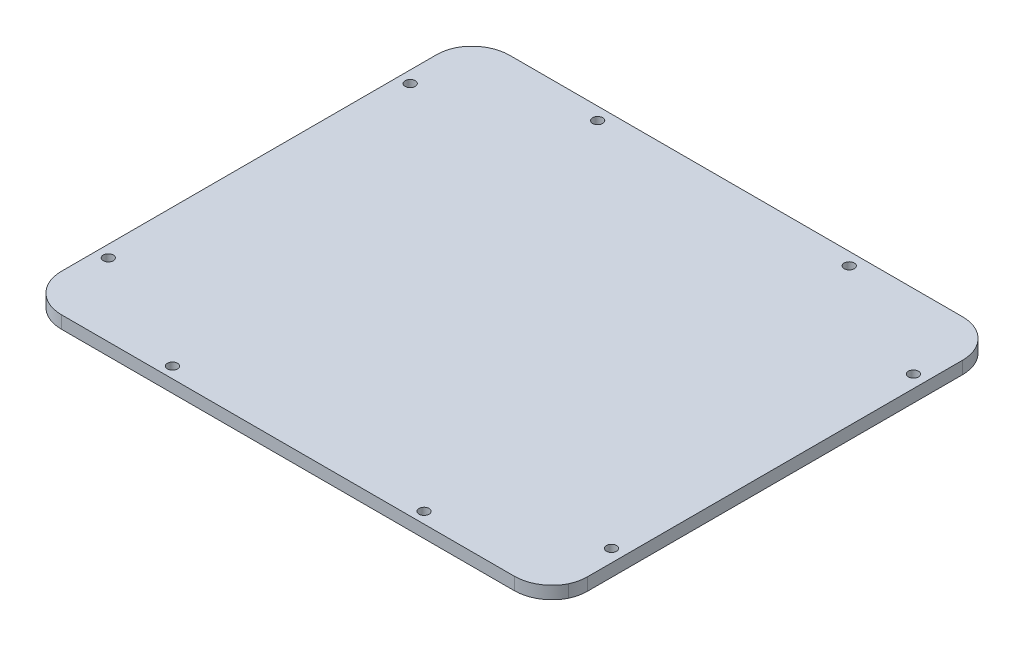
ISO-10303-21;
HEADER;
FILE_DESCRIPTION(('STEP AP214'),'2;1');
FILE_NAME('part.step','',(''),(''),'','','');
FILE_SCHEMA(('AUTOMOTIVE_DESIGN { 1 0 10303 214 1 1 1 1 }'));
ENDSEC;
DATA;
#1=APPLICATION_CONTEXT('core data for automotive mechanical design processes');
#2=APPLICATION_PROTOCOL_DEFINITION('international standard','automotive_design',2000,#1);
#3=PRODUCT_CONTEXT('',#1,'mechanical');
#4=PRODUCT('Part','Part','',(#3));
#5=PRODUCT_RELATED_PRODUCT_CATEGORY('part','',(#4));
#6=PRODUCT_DEFINITION_FORMATION('','',#4);
#7=PRODUCT_DEFINITION_CONTEXT('part definition',#1,'design');
#8=PRODUCT_DEFINITION('design','',#6,#7);
#9=PRODUCT_DEFINITION_SHAPE('','',#8);
#10=(LENGTH_UNIT() NAMED_UNIT(*) SI_UNIT(.MILLI.,.METRE.));
#11=(NAMED_UNIT(*) PLANE_ANGLE_UNIT() SI_UNIT($,.RADIAN.));
#12=(NAMED_UNIT(*) SI_UNIT($,.STERADIAN.) SOLID_ANGLE_UNIT());
#13=UNCERTAINTY_MEASURE_WITH_UNIT(LENGTH_MEASURE(1.E-05),#10,'distance_accuracy_value','');
#14=(GEOMETRIC_REPRESENTATION_CONTEXT(3) GLOBAL_UNCERTAINTY_ASSIGNED_CONTEXT((#13)) GLOBAL_UNIT_ASSIGNED_CONTEXT((#10,
#11,#12)) REPRESENTATION_CONTEXT('',''));
#15=CARTESIAN_POINT('',(0.,0.,0.));
#16=DIRECTION('',(0.,0.,1.));
#17=DIRECTION('',(1.,0.,0.));
#18=AXIS2_PLACEMENT_3D('',#15,#16,#17);
#19=CARTESIAN_POINT('',(0.,5.,-88.8910959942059));
#20=DIRECTION('',(0.,0.,1.));
#21=DIRECTION('',(1.,0.,0.));
#22=AXIS2_PLACEMENT_3D('',#19,#20,#21);
#23=PLANE('',#22);
#24=DIRECTION('',(-1.,0.,0.));
#25=VECTOR('',#24,1.);
#26=CARTESIAN_POINT('',(0.,0.,-88.8910959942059));
#27=LINE('',#26,#25);
#28=CARTESIAN_POINT('',(89.7019969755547,0.,-88.8910959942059));
#29=VERTEX_POINT('',#28);
#30=CARTESIAN_POINT('',(-90.2980030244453,0.,-88.8910959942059));
#31=VERTEX_POINT('',#30);
#32=EDGE_CURVE('E175',#29,#31,#27,.T.);
#33=ORIENTED_EDGE('',*,*,#32,.T.);
#34=DIRECTION('',(0.,-1.,0.));
#35=VECTOR('',#34,1.);
#36=CARTESIAN_POINT('',(-90.2980030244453,5.,-88.8910959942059));
#37=LINE('',#36,#35);
#38=CARTESIAN_POINT('',(-90.2980030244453,5.,-88.8910959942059));
#39=VERTEX_POINT('',#38);
#40=EDGE_CURVE('E11',#39,#31,#37,.T.);
#41=ORIENTED_EDGE('',*,*,#40,.F.);
#42=DIRECTION('',(-1.,0.,0.));
#43=VECTOR('',#42,1.);
#44=CARTESIAN_POINT('',(0.,5.,-88.8910959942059));
#45=LINE('',#44,#43);
#46=CARTESIAN_POINT('',(89.7019969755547,5.,-88.8910959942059));
#47=VERTEX_POINT('',#46);
#48=EDGE_CURVE('E226',#47,#39,#45,.T.);
#49=ORIENTED_EDGE('',*,*,#48,.F.);
#50=DIRECTION('',(0.,-1.,0.));
#51=VECTOR('',#50,1.);
#52=CARTESIAN_POINT('',(89.7019969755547,5.,-88.8910959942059));
#53=LINE('',#52,#51);
#54=EDGE_CURVE('E145',#47,#29,#53,.T.);
#55=ORIENTED_EDGE('',*,*,#54,.T.);
#56=EDGE_LOOP('',(#33,#41,#49,#55));
#57=FACE_BOUND('',#56,.T.);
#58=ADVANCED_FACE('F39',(#57),#23,.F.);
#59=CARTESIAN_POINT('',(-90.2980030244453,5.,-73.8910959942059));
#60=DIRECTION('',(0.,-1.,0.));
#61=DIRECTION('',(0.,0.,-1.));
#62=AXIS2_PLACEMENT_3D('',#59,#60,#61);
#63=CYLINDRICAL_SURFACE('',#62,15.);
#64=CARTESIAN_POINT('',(-90.2980030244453,0.,-73.8910959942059));
#65=DIRECTION('',(0.,1.,0.));
#66=DIRECTION('',(0.,0.,1.));
#67=AXIS2_PLACEMENT_3D('',#64,#65,#66);
#68=CIRCLE('',#67,15.);
#69=CARTESIAN_POINT('',(-103.618561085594,0.,-80.7876699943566));
#70=VERTEX_POINT('',#69);
#71=EDGE_CURVE('E173',#31,#70,#68,.T.);
#72=ORIENTED_EDGE('',*,*,#71,.T.);
#73=DIRECTION('',(0.,-1.,0.));
#74=VECTOR('',#73,1.);
#75=CARTESIAN_POINT('',(-103.618561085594,5.,-80.7876699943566));
#76=LINE('',#75,#74);
#77=CARTESIAN_POINT('',(-103.618561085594,5.,-80.7876699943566));
#78=VERTEX_POINT('',#77);
#79=EDGE_CURVE('E48',#78,#70,#76,.T.);
#80=ORIENTED_EDGE('',*,*,#79,.F.);
#81=CARTESIAN_POINT('',(-90.2980030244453,5.,-73.8910959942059));
#82=DIRECTION('',(0.,1.,0.));
#83=DIRECTION('',(0.,0.,1.));
#84=AXIS2_PLACEMENT_3D('',#81,#82,#83);
#85=CIRCLE('',#84,15.);
#86=EDGE_CURVE('E104',#39,#78,#85,.T.);
#87=ORIENTED_EDGE('',*,*,#86,.F.);
#88=ORIENTED_EDGE('',*,*,#40,.T.);
#89=EDGE_LOOP('',(#72,#80,#87,#88));
#90=FACE_BOUND('',#89,.T.);
#91=ADVANCED_FACE('F215',(#90),#63,.T.);
#92=CARTESIAN_POINT('',(-90.,5.,-74.5));
#93=DIRECTION('',(0.,-1.,0.));
#94=DIRECTION('',(0.,0.,-1.));
#95=AXIS2_PLACEMENT_3D('',#92,#93,#94);
#96=CYLINDRICAL_SURFACE('',#95,15.);
#97=CARTESIAN_POINT('',(-90.,0.,-74.5));
#98=DIRECTION('',(0.,1.,0.));
#99=DIRECTION('',(0.,0.,1.));
#100=AXIS2_PLACEMENT_3D('',#97,#98,#99);
#101=CIRCLE('',#100,15.);
#102=CARTESIAN_POINT('',(-105.,0.,-74.5));
#103=VERTEX_POINT('',#102);
#104=EDGE_CURVE('E179',#103,#70,#101,.F.);
#105=ORIENTED_EDGE('',*,*,#104,.F.);
#106=DIRECTION('',(0.,-1.,0.));
#107=VECTOR('',#106,1.);
#108=CARTESIAN_POINT('',(-105.,5.,-74.5));
#109=LINE('',#108,#107);
#110=CARTESIAN_POINT('',(-105.,5.,-74.5));
#111=VERTEX_POINT('',#110);
#112=EDGE_CURVE('E202',#111,#103,#109,.T.);
#113=ORIENTED_EDGE('',*,*,#112,.F.);
#114=CARTESIAN_POINT('',(-90.,5.,-74.5));
#115=DIRECTION('',(0.,1.,0.));
#116=DIRECTION('',(0.,0.,1.));
#117=AXIS2_PLACEMENT_3D('',#114,#115,#116);
#118=CIRCLE('',#117,15.);
#119=EDGE_CURVE('E211',#111,#78,#118,.F.);
#120=ORIENTED_EDGE('',*,*,#119,.T.);
#121=ORIENTED_EDGE('',*,*,#79,.T.);
#122=EDGE_LOOP('',(#105,#113,#120,#121));
#123=FACE_BOUND('',#122,.T.);
#124=ADVANCED_FACE('F207',(#123),#96,.T.);
#125=CARTESIAN_POINT('',(-105.,5.,0.));
#126=DIRECTION('',(-1.,0.,0.));
#127=DIRECTION('',(0.,0.,1.));
#128=AXIS2_PLACEMENT_3D('',#125,#126,#127);
#129=PLANE('',#128);
#130=DIRECTION('',(0.,0.,-1.));
#131=VECTOR('',#130,1.);
#132=CARTESIAN_POINT('',(-105.,0.,0.));
#133=LINE('',#132,#131);
#134=CARTESIAN_POINT('',(-105.,0.,74.5));
#135=VERTEX_POINT('',#134);
#136=EDGE_CURVE('E182',#135,#103,#133,.T.);
#137=ORIENTED_EDGE('',*,*,#136,.F.);
#138=DIRECTION('',(0.,-1.,0.));
#139=VECTOR('',#138,1.);
#140=CARTESIAN_POINT('',(-105.,5.,74.5));
#141=LINE('',#140,#139);
#142=CARTESIAN_POINT('',(-105.,5.,74.5));
#143=VERTEX_POINT('',#142);
#144=EDGE_CURVE('E201',#143,#135,#141,.T.);
#145=ORIENTED_EDGE('',*,*,#144,.F.);
#146=DIRECTION('',(0.,0.,-1.));
#147=VECTOR('',#146,1.);
#148=CARTESIAN_POINT('',(-105.,5.,0.));
#149=LINE('',#148,#147);
#150=EDGE_CURVE('E223',#143,#111,#149,.T.);
#151=ORIENTED_EDGE('',*,*,#150,.T.);
#152=ORIENTED_EDGE('',*,*,#112,.T.);
#153=EDGE_LOOP('',(#137,#145,#151,#152));
#154=FACE_BOUND('',#153,.T.);
#155=ADVANCED_FACE('F222',(#154),#129,.T.);
#156=CARTESIAN_POINT('',(-90.,5.,74.5));
#157=DIRECTION('',(0.,-1.,0.));
#158=DIRECTION('',(0.,0.,-1.));
#159=AXIS2_PLACEMENT_3D('',#156,#157,#158);
#160=CYLINDRICAL_SURFACE('',#159,15.);
#161=CARTESIAN_POINT('',(-90.,0.,74.5));
#162=DIRECTION('',(0.,1.,0.));
#163=DIRECTION('',(0.,0.,1.));
#164=AXIS2_PLACEMENT_3D('',#161,#162,#163);
#165=CIRCLE('',#164,15.);
#166=CARTESIAN_POINT('',(-90.,0.,89.5));
#167=VERTEX_POINT('',#166);
#168=EDGE_CURVE('E184',#135,#167,#165,.T.);
#169=ORIENTED_EDGE('',*,*,#168,.T.);
#170=DIRECTION('',(0.,-1.,0.));
#171=VECTOR('',#170,1.);
#172=CARTESIAN_POINT('',(-90.,5.,89.5));
#173=LINE('',#172,#171);
#174=CARTESIAN_POINT('',(-90.,5.,89.5));
#175=VERTEX_POINT('',#174);
#176=EDGE_CURVE('E199',#175,#167,#173,.T.);
#177=ORIENTED_EDGE('',*,*,#176,.F.);
#178=CARTESIAN_POINT('',(-90.,5.,74.5));
#179=DIRECTION('',(0.,1.,0.));
#180=DIRECTION('',(0.,0.,1.));
#181=AXIS2_PLACEMENT_3D('',#178,#179,#180);
#182=CIRCLE('',#181,15.);
#183=EDGE_CURVE('E230',#143,#175,#182,.T.);
#184=ORIENTED_EDGE('',*,*,#183,.F.);
#185=ORIENTED_EDGE('',*,*,#144,.T.);
#186=EDGE_LOOP('',(#169,#177,#184,#185));
#187=FACE_BOUND('',#186,.T.);
#188=ADVANCED_FACE('F411',(#187),#160,.T.);
#189=CARTESIAN_POINT('',(0.,5.,89.5));
#190=DIRECTION('',(0.,0.,-1.));
#191=DIRECTION('',(-1.,0.,0.));
#192=AXIS2_PLACEMENT_3D('',#189,#190,#191);
#193=PLANE('',#192);
#194=DIRECTION('',(1.,0.,0.));
#195=VECTOR('',#194,1.);
#196=CARTESIAN_POINT('',(0.,0.,89.5));
#197=LINE('',#196,#195);
#198=CARTESIAN_POINT('',(90.,0.,89.5));
#199=VERTEX_POINT('',#198);
#200=EDGE_CURVE('E187',#167,#199,#197,.T.);
#201=ORIENTED_EDGE('',*,*,#200,.T.);
#202=DIRECTION('',(0.,-1.,0.));
#203=VECTOR('',#202,1.);
#204=CARTESIAN_POINT('',(90.,5.,89.5));
#205=LINE('',#204,#203);
#206=CARTESIAN_POINT('',(90.,5.,89.5));
#207=VERTEX_POINT('',#206);
#208=EDGE_CURVE('E197',#207,#199,#205,.T.);
#209=ORIENTED_EDGE('',*,*,#208,.F.);
#210=DIRECTION('',(1.,0.,0.));
#211=VECTOR('',#210,1.);
#212=CARTESIAN_POINT('',(0.,5.,89.5));
#213=LINE('',#212,#211);
#214=EDGE_CURVE('E233',#175,#207,#213,.T.);
#215=ORIENTED_EDGE('',*,*,#214,.F.);
#216=ORIENTED_EDGE('',*,*,#176,.T.);
#217=EDGE_LOOP('',(#201,#209,#215,#216));
#218=FACE_BOUND('',#217,.T.);
#219=ADVANCED_FACE('F239',(#218),#193,.F.);
#220=CARTESIAN_POINT('',(90.,5.,74.5));
#221=DIRECTION('',(0.,-1.,0.));
#222=DIRECTION('',(0.,0.,-1.));
#223=AXIS2_PLACEMENT_3D('',#220,#221,#222);
#224=CYLINDRICAL_SURFACE('',#223,15.);
#225=CARTESIAN_POINT('',(90.,0.,74.5));
#226=DIRECTION('',(0.,1.,0.));
#227=DIRECTION('',(0.,0.,1.));
#228=AXIS2_PLACEMENT_3D('',#225,#226,#227);
#229=CIRCLE('',#228,15.);
#230=CARTESIAN_POINT('',(103.320558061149,0.,81.3965740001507));
#231=VERTEX_POINT('',#230);
#232=EDGE_CURVE('E189',#199,#231,#229,.T.);
#233=ORIENTED_EDGE('',*,*,#232,.T.);
#234=DIRECTION('',(0.,-1.,0.));
#235=VECTOR('',#234,1.);
#236=CARTESIAN_POINT('',(103.320558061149,5.,81.3965740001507));
#237=LINE('',#236,#235);
#238=CARTESIAN_POINT('',(103.320558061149,5.,81.3965740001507));
#239=VERTEX_POINT('',#238);
#240=EDGE_CURVE('E138',#239,#231,#237,.T.);
#241=ORIENTED_EDGE('',*,*,#240,.F.);
#242=CARTESIAN_POINT('',(90.,5.,74.5));
#243=DIRECTION('',(0.,1.,0.));
#244=DIRECTION('',(0.,0.,1.));
#245=AXIS2_PLACEMENT_3D('',#242,#243,#244);
#246=CIRCLE('',#245,15.);
#247=EDGE_CURVE('E128',#207,#239,#246,.T.);
#248=ORIENTED_EDGE('',*,*,#247,.F.);
#249=ORIENTED_EDGE('',*,*,#208,.T.);
#250=EDGE_LOOP('',(#233,#241,#248,#249));
#251=FACE_BOUND('',#250,.T.);
#252=ADVANCED_FACE('F245',(#251),#224,.T.);
#253=CARTESIAN_POINT('',(89.7019969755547,5.,75.1089040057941));
#254=DIRECTION('',(0.,-1.,0.));
#255=DIRECTION('',(0.,0.,-1.));
#256=AXIS2_PLACEMENT_3D('',#253,#254,#255);
#257=CYLINDRICAL_SURFACE('',#256,15.);
#258=CARTESIAN_POINT('',(89.7019969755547,0.,75.1089040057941));
#259=DIRECTION('',(0.,1.,0.));
#260=DIRECTION('',(0.,0.,1.));
#261=AXIS2_PLACEMENT_3D('',#258,#259,#260);
#262=CIRCLE('',#261,15.);
#263=CARTESIAN_POINT('',(104.701996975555,0.,75.1089040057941));
#264=VERTEX_POINT('',#263);
#265=EDGE_CURVE('E139',#231,#264,#262,.T.);
#266=ORIENTED_EDGE('',*,*,#265,.T.);
#267=DIRECTION('',(0.,-1.,0.));
#268=VECTOR('',#267,1.);
#269=CARTESIAN_POINT('',(104.701996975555,5.,75.1089040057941));
#270=LINE('',#269,#268);
#271=CARTESIAN_POINT('',(104.701996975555,5.,75.1089040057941));
#272=VERTEX_POINT('',#271);
#273=EDGE_CURVE('E133',#272,#264,#270,.T.);
#274=ORIENTED_EDGE('',*,*,#273,.F.);
#275=CARTESIAN_POINT('',(89.7019969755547,5.,75.1089040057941));
#276=DIRECTION('',(0.,1.,0.));
#277=DIRECTION('',(0.,0.,1.));
#278=AXIS2_PLACEMENT_3D('',#275,#276,#277);
#279=CIRCLE('',#278,15.);
#280=EDGE_CURVE('E123',#239,#272,#279,.T.);
#281=ORIENTED_EDGE('',*,*,#280,.F.);
#282=ORIENTED_EDGE('',*,*,#240,.T.);
#283=EDGE_LOOP('',(#266,#274,#281,#282));
#284=FACE_BOUND('',#283,.T.);
#285=ADVANCED_FACE('F136',(#284),#257,.T.);
#286=CARTESIAN_POINT('',(104.701996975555,5.,0.));
#287=DIRECTION('',(-1.,0.,0.));
#288=DIRECTION('',(0.,0.,1.));
#289=AXIS2_PLACEMENT_3D('',#286,#287,#288);
#290=PLANE('',#289);
#291=DIRECTION('',(0.,0.,-1.));
#292=VECTOR('',#291,1.);
#293=CARTESIAN_POINT('',(104.701996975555,0.,0.));
#294=LINE('',#293,#292);
#295=CARTESIAN_POINT('',(104.701996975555,0.,-73.8910959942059));
#296=VERTEX_POINT('',#295);
#297=EDGE_CURVE('E93',#264,#296,#294,.T.);
#298=ORIENTED_EDGE('',*,*,#297,.T.);
#299=DIRECTION('',(0.,-1.,0.));
#300=VECTOR('',#299,1.);
#301=CARTESIAN_POINT('',(104.701996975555,5.,-73.8910959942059));
#302=LINE('',#301,#300);
#303=CARTESIAN_POINT('',(104.701996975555,5.,-73.8910959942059));
#304=VERTEX_POINT('',#303);
#305=EDGE_CURVE('E140',#304,#296,#302,.T.);
#306=ORIENTED_EDGE('',*,*,#305,.F.);
#307=DIRECTION('',(0.,0.,-1.));
#308=VECTOR('',#307,1.);
#309=CARTESIAN_POINT('',(104.701996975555,5.,0.));
#310=LINE('',#309,#308);
#311=EDGE_CURVE('E126',#272,#304,#310,.T.);
#312=ORIENTED_EDGE('',*,*,#311,.F.);
#313=ORIENTED_EDGE('',*,*,#273,.T.);
#314=EDGE_LOOP('',(#298,#306,#312,#313));
#315=FACE_BOUND('',#314,.T.);
#316=ADVANCED_FACE('F142',(#315),#290,.F.);
#317=CARTESIAN_POINT('',(-50.2980030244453,5.,-83.8910959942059));
#318=DIRECTION('',(0.,-1.,0.));
#319=DIRECTION('',(0.,0.,-1.));
#320=AXIS2_PLACEMENT_3D('',#317,#318,#319);
#321=CYLINDRICAL_SURFACE('',#320,2.);
#322=CARTESIAN_POINT('',(-50.2980030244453,5.,-83.8910959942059));
#323=DIRECTION('',(0.,1.,0.));
#324=DIRECTION('',(0.,0.,1.));
#325=AXIS2_PLACEMENT_3D('',#322,#323,#324);
#326=CIRCLE('',#325,2.);
#327=CARTESIAN_POINT('',(-50.2980030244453,5.,-81.8910959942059));
#328=VERTEX_POINT('',#327);
#329=EDGE_CURVE('E468',#328,#328,#326,.T.);
#330=ORIENTED_EDGE('',*,*,#329,.T.);
#331=EDGE_LOOP('',(#330));
#332=FACE_BOUND('',#331,.T.);
#333=CARTESIAN_POINT('',(-50.2980030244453,0.,-83.8910959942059));
#334=DIRECTION('',(0.,1.,0.));
#335=DIRECTION('',(0.,0.,1.));
#336=AXIS2_PLACEMENT_3D('',#333,#334,#335);
#337=CIRCLE('',#336,2.);
#338=CARTESIAN_POINT('',(-50.2980030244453,0.,-81.8910959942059));
#339=VERTEX_POINT('',#338);
#340=EDGE_CURVE('E166',#339,#339,#337,.T.);
#341=ORIENTED_EDGE('',*,*,#340,.F.);
#342=EDGE_LOOP('',(#341));
#343=FACE_BOUND('',#342,.T.);
#344=ADVANCED_FACE('F266',(#332,#343),#321,.F.);
#345=CARTESIAN_POINT('',(49.7019969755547,5.,-83.8910959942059));
#346=DIRECTION('',(0.,-1.,0.));
#347=DIRECTION('',(0.,0.,-1.));
#348=AXIS2_PLACEMENT_3D('',#345,#346,#347);
#349=CYLINDRICAL_SURFACE('',#348,2.);
#350=CARTESIAN_POINT('',(49.7019969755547,5.,-83.8910959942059));
#351=DIRECTION('',(0.,1.,0.));
#352=DIRECTION('',(0.,0.,1.));
#353=AXIS2_PLACEMENT_3D('',#350,#351,#352);
#354=CIRCLE('',#353,2.);
#355=CARTESIAN_POINT('',(49.7019969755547,5.,-81.8910959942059));
#356=VERTEX_POINT('',#355);
#357=EDGE_CURVE('E466',#356,#356,#354,.T.);
#358=ORIENTED_EDGE('',*,*,#357,.T.);
#359=EDGE_LOOP('',(#358));
#360=FACE_BOUND('',#359,.T.);
#361=CARTESIAN_POINT('',(49.7019969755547,0.,-83.8910959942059));
#362=DIRECTION('',(0.,1.,0.));
#363=DIRECTION('',(0.,0.,1.));
#364=AXIS2_PLACEMENT_3D('',#361,#362,#363);
#365=CIRCLE('',#364,2.);
#366=CARTESIAN_POINT('',(49.7019969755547,0.,-81.8910959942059));
#367=VERTEX_POINT('',#366);
#368=EDGE_CURVE('E167',#367,#367,#365,.T.);
#369=ORIENTED_EDGE('',*,*,#368,.F.);
#370=EDGE_LOOP('',(#369));
#371=FACE_BOUND('',#370,.T.);
#372=ADVANCED_FACE('F267',(#360,#371),#349,.F.);
#373=CARTESIAN_POINT('',(99.7019969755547,5.,-59.3910959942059));
#374=DIRECTION('',(0.,-1.,0.));
#375=DIRECTION('',(0.,0.,-1.));
#376=AXIS2_PLACEMENT_3D('',#373,#374,#375);
#377=CYLINDRICAL_SURFACE('',#376,2.);
#378=CARTESIAN_POINT('',(99.7019969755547,5.,-59.3910959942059));
#379=DIRECTION('',(0.,1.,0.));
#380=DIRECTION('',(0.,0.,1.));
#381=AXIS2_PLACEMENT_3D('',#378,#379,#380);
#382=CIRCLE('',#381,2.);
#383=CARTESIAN_POINT('',(99.7019969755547,5.,-57.3910959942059));
#384=VERTEX_POINT('',#383);
#385=EDGE_CURVE('E464',#384,#384,#382,.T.);
#386=ORIENTED_EDGE('',*,*,#385,.T.);
#387=EDGE_LOOP('',(#386));
#388=FACE_BOUND('',#387,.T.);
#389=CARTESIAN_POINT('',(99.7019969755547,0.,-59.3910959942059));
#390=DIRECTION('',(0.,1.,0.));
#391=DIRECTION('',(0.,0.,1.));
#392=AXIS2_PLACEMENT_3D('',#389,#390,#391);
#393=CIRCLE('',#392,2.);
#394=CARTESIAN_POINT('',(99.7019969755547,0.,-57.3910959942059));
#395=VERTEX_POINT('',#394);
#396=EDGE_CURVE('E162',#395,#395,#393,.T.);
#397=ORIENTED_EDGE('',*,*,#396,.F.);
#398=EDGE_LOOP('',(#397));
#399=FACE_BOUND('',#398,.T.);
#400=ADVANCED_FACE('F272',(#388,#399),#377,.F.);
#401=CARTESIAN_POINT('',(99.7019969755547,5.,60.6089040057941));
#402=DIRECTION('',(0.,-1.,0.));
#403=DIRECTION('',(0.,0.,-1.));
#404=AXIS2_PLACEMENT_3D('',#401,#402,#403);
#405=CYLINDRICAL_SURFACE('',#404,2.);
#406=CARTESIAN_POINT('',(99.7019969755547,5.,60.6089040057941));
#407=DIRECTION('',(0.,1.,0.));
#408=DIRECTION('',(0.,0.,1.));
#409=AXIS2_PLACEMENT_3D('',#406,#407,#408);
#410=CIRCLE('',#409,2.);
#411=CARTESIAN_POINT('',(99.7019969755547,5.,62.6089040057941));
#412=VERTEX_POINT('',#411);
#413=EDGE_CURVE('E458',#412,#412,#410,.T.);
#414=ORIENTED_EDGE('',*,*,#413,.T.);
#415=EDGE_LOOP('',(#414));
#416=FACE_BOUND('',#415,.T.);
#417=CARTESIAN_POINT('',(99.7019969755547,0.,60.6089040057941));
#418=DIRECTION('',(0.,1.,0.));
#419=DIRECTION('',(0.,0.,1.));
#420=AXIS2_PLACEMENT_3D('',#417,#418,#419);
#421=CIRCLE('',#420,2.);
#422=CARTESIAN_POINT('',(99.7019969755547,0.,62.6089040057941));
#423=VERTEX_POINT('',#422);
#424=EDGE_CURVE('E159',#423,#423,#421,.T.);
#425=ORIENTED_EDGE('',*,*,#424,.F.);
#426=EDGE_LOOP('',(#425));
#427=FACE_BOUND('',#426,.T.);
#428=ADVANCED_FACE('F280',(#416,#427),#405,.F.);
#429=CARTESIAN_POINT('',(49.7019969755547,5.,85.1089040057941));
#430=DIRECTION('',(0.,-1.,0.));
#431=DIRECTION('',(0.,0.,-1.));
#432=AXIS2_PLACEMENT_3D('',#429,#430,#431);
#433=CYLINDRICAL_SURFACE('',#432,2.);
#434=CARTESIAN_POINT('',(49.7019969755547,5.,85.1089040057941));
#435=DIRECTION('',(0.,1.,0.));
#436=DIRECTION('',(0.,0.,1.));
#437=AXIS2_PLACEMENT_3D('',#434,#435,#436);
#438=CIRCLE('',#437,2.);
#439=CARTESIAN_POINT('',(49.7019969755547,5.,87.1089040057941));
#440=VERTEX_POINT('',#439);
#441=EDGE_CURVE('E454',#440,#440,#438,.T.);
#442=ORIENTED_EDGE('',*,*,#441,.T.);
#443=EDGE_LOOP('',(#442));
#444=FACE_BOUND('',#443,.T.);
#445=CARTESIAN_POINT('',(49.7019969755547,0.,85.1089040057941));
#446=DIRECTION('',(0.,1.,0.));
#447=DIRECTION('',(0.,0.,1.));
#448=AXIS2_PLACEMENT_3D('',#445,#446,#447);
#449=CIRCLE('',#448,2.);
#450=CARTESIAN_POINT('',(49.7019969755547,0.,87.1089040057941));
#451=VERTEX_POINT('',#450);
#452=EDGE_CURVE('E160',#451,#451,#449,.T.);
#453=ORIENTED_EDGE('',*,*,#452,.F.);
#454=EDGE_LOOP('',(#453));
#455=FACE_BOUND('',#454,.T.);
#456=ADVANCED_FACE('F282',(#444,#455),#433,.F.);
#457=CARTESIAN_POINT('',(-50.2980030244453,5.,85.1089040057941));
#458=DIRECTION('',(0.,-1.,0.));
#459=DIRECTION('',(0.,0.,-1.));
#460=AXIS2_PLACEMENT_3D('',#457,#458,#459);
#461=CYLINDRICAL_SURFACE('',#460,2.);
#462=CARTESIAN_POINT('',(-50.2980030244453,5.,85.1089040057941));
#463=DIRECTION('',(0.,1.,0.));
#464=DIRECTION('',(0.,0.,1.));
#465=AXIS2_PLACEMENT_3D('',#462,#463,#464);
#466=CIRCLE('',#465,2.);
#467=CARTESIAN_POINT('',(-50.2980030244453,5.,87.1089040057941));
#468=VERTEX_POINT('',#467);
#469=EDGE_CURVE('E448',#468,#468,#466,.T.);
#470=ORIENTED_EDGE('',*,*,#469,.T.);
#471=EDGE_LOOP('',(#470));
#472=FACE_BOUND('',#471,.T.);
#473=CARTESIAN_POINT('',(-50.2980030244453,0.,85.1089040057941));
#474=DIRECTION('',(0.,1.,0.));
#475=DIRECTION('',(0.,0.,1.));
#476=AXIS2_PLACEMENT_3D('',#473,#474,#475);
#477=CIRCLE('',#476,2.);
#478=CARTESIAN_POINT('',(-50.2980030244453,0.,87.1089040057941));
#479=VERTEX_POINT('',#478);
#480=EDGE_CURVE('E152',#479,#479,#477,.T.);
#481=ORIENTED_EDGE('',*,*,#480,.F.);
#482=EDGE_LOOP('',(#481));
#483=FACE_BOUND('',#482,.T.);
#484=ADVANCED_FACE('F283',(#472,#483),#461,.F.);
#485=CARTESIAN_POINT('',(-100.298003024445,5.,60.6089040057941));
#486=DIRECTION('',(0.,-1.,0.));
#487=DIRECTION('',(0.,0.,-1.));
#488=AXIS2_PLACEMENT_3D('',#485,#486,#487);
#489=CYLINDRICAL_SURFACE('',#488,2.);
#490=CARTESIAN_POINT('',(-100.298003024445,5.,60.6089040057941));
#491=DIRECTION('',(0.,1.,0.));
#492=DIRECTION('',(0.,0.,1.));
#493=AXIS2_PLACEMENT_3D('',#490,#491,#492);
#494=CIRCLE('',#493,2.);
#495=CARTESIAN_POINT('',(-100.298003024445,5.,62.6089040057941));
#496=VERTEX_POINT('',#495);
#497=EDGE_CURVE('E297',#496,#496,#494,.T.);
#498=ORIENTED_EDGE('',*,*,#497,.T.);
#499=EDGE_LOOP('',(#498));
#500=FACE_BOUND('',#499,.T.);
#501=CARTESIAN_POINT('',(-100.298003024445,0.,60.6089040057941));
#502=DIRECTION('',(0.,1.,0.));
#503=DIRECTION('',(0.,0.,1.));
#504=AXIS2_PLACEMENT_3D('',#501,#502,#503);
#505=CIRCLE('',#504,2.);
#506=CARTESIAN_POINT('',(-100.298003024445,0.,62.6089040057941));
#507=VERTEX_POINT('',#506);
#508=EDGE_CURVE('E151',#507,#507,#505,.T.);
#509=ORIENTED_EDGE('',*,*,#508,.F.);
#510=EDGE_LOOP('',(#509));
#511=FACE_BOUND('',#510,.T.);
#512=ADVANCED_FACE('F255',(#500,#511),#489,.F.);
#513=CARTESIAN_POINT('',(-100.298003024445,5.,-59.3910959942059));
#514=DIRECTION('',(0.,-1.,0.));
#515=DIRECTION('',(0.,0.,-1.));
#516=AXIS2_PLACEMENT_3D('',#513,#514,#515);
#517=CYLINDRICAL_SURFACE('',#516,2.);
#518=CARTESIAN_POINT('',(-100.298003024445,5.,-59.3910959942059));
#519=DIRECTION('',(0.,1.,0.));
#520=DIRECTION('',(0.,0.,1.));
#521=AXIS2_PLACEMENT_3D('',#518,#519,#520);
#522=CIRCLE('',#521,2.);
#523=CARTESIAN_POINT('',(-100.298003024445,5.,-57.3910959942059));
#524=VERTEX_POINT('',#523);
#525=EDGE_CURVE('E194',#524,#524,#522,.T.);
#526=ORIENTED_EDGE('',*,*,#525,.T.);
#527=EDGE_LOOP('',(#526));
#528=FACE_BOUND('',#527,.T.);
#529=CARTESIAN_POINT('',(-100.298003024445,0.,-59.3910959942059));
#530=DIRECTION('',(0.,1.,0.));
#531=DIRECTION('',(0.,0.,1.));
#532=AXIS2_PLACEMENT_3D('',#529,#530,#531);
#533=CIRCLE('',#532,2.);
#534=CARTESIAN_POINT('',(-100.298003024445,0.,-57.3910959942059));
#535=VERTEX_POINT('',#534);
#536=EDGE_CURVE('E146',#535,#535,#533,.T.);
#537=ORIENTED_EDGE('',*,*,#536,.F.);
#538=EDGE_LOOP('',(#537));
#539=FACE_BOUND('',#538,.T.);
#540=ADVANCED_FACE('F41',(#528,#539),#517,.F.);
#541=CARTESIAN_POINT('',(89.7019969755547,5.,-73.8910959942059));
#542=DIRECTION('',(0.,-1.,0.));
#543=DIRECTION('',(0.,0.,-1.));
#544=AXIS2_PLACEMENT_3D('',#541,#542,#543);
#545=CYLINDRICAL_SURFACE('',#544,15.);
#546=CARTESIAN_POINT('',(89.7019969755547,0.,-73.8910959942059));
#547=DIRECTION('',(0.,1.,0.));
#548=DIRECTION('',(0.,0.,1.));
#549=AXIS2_PLACEMENT_3D('',#546,#547,#548);
#550=CIRCLE('',#549,15.);
#551=EDGE_CURVE('E100',#296,#29,#550,.T.);
#552=ORIENTED_EDGE('',*,*,#551,.T.);
#553=ORIENTED_EDGE('',*,*,#54,.F.);
#554=CARTESIAN_POINT('',(89.7019969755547,5.,-73.8910959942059));
#555=DIRECTION('',(0.,1.,0.));
#556=DIRECTION('',(0.,0.,1.));
#557=AXIS2_PLACEMENT_3D('',#554,#555,#556);
#558=CIRCLE('',#557,15.);
#559=EDGE_CURVE('E57',#304,#47,#558,.T.);
#560=ORIENTED_EDGE('',*,*,#559,.F.);
#561=ORIENTED_EDGE('',*,*,#305,.T.);
#562=EDGE_LOOP('',(#552,#553,#560,#561));
#563=FACE_BOUND('',#562,.T.);
#564=ADVANCED_FACE('F243',(#563),#545,.T.);
#565=CARTESIAN_POINT('',(0.,5.,0.));
#566=DIRECTION('',(0.,1.,0.));
#567=DIRECTION('',(0.,0.,1.));
#568=AXIS2_PLACEMENT_3D('',#565,#566,#567);
#569=PLANE('',#568);
#570=ORIENTED_EDGE('',*,*,#525,.F.);
#571=EDGE_LOOP('',(#570));
#572=FACE_BOUND('',#571,.T.);
#573=ORIENTED_EDGE('',*,*,#497,.F.);
#574=EDGE_LOOP('',(#573));
#575=FACE_BOUND('',#574,.T.);
#576=ORIENTED_EDGE('',*,*,#469,.F.);
#577=EDGE_LOOP('',(#576));
#578=FACE_BOUND('',#577,.T.);
#579=ORIENTED_EDGE('',*,*,#441,.F.);
#580=EDGE_LOOP('',(#579));
#581=FACE_BOUND('',#580,.T.);
#582=ORIENTED_EDGE('',*,*,#413,.F.);
#583=EDGE_LOOP('',(#582));
#584=FACE_BOUND('',#583,.T.);
#585=ORIENTED_EDGE('',*,*,#385,.F.);
#586=EDGE_LOOP('',(#585));
#587=FACE_BOUND('',#586,.T.);
#588=ORIENTED_EDGE('',*,*,#357,.F.);
#589=EDGE_LOOP('',(#588));
#590=FACE_BOUND('',#589,.T.);
#591=ORIENTED_EDGE('',*,*,#329,.F.);
#592=EDGE_LOOP('',(#591));
#593=FACE_BOUND('',#592,.T.);
#594=ORIENTED_EDGE('',*,*,#48,.T.);
#595=ORIENTED_EDGE('',*,*,#86,.T.);
#596=ORIENTED_EDGE('',*,*,#119,.F.);
#597=ORIENTED_EDGE('',*,*,#150,.F.);
#598=ORIENTED_EDGE('',*,*,#183,.T.);
#599=ORIENTED_EDGE('',*,*,#214,.T.);
#600=ORIENTED_EDGE('',*,*,#247,.T.);
#601=ORIENTED_EDGE('',*,*,#280,.T.);
#602=ORIENTED_EDGE('',*,*,#311,.T.);
#603=ORIENTED_EDGE('',*,*,#559,.T.);
#604=EDGE_LOOP('',(#594,#595,#596,#597,#598,#599,#600,#601,#602,#603));
#605=FACE_BOUND('',#604,.T.);
#606=ADVANCED_FACE('F127',(#572,#575,#578,#581,#584,#587,#590,#593,#605),#569,.T.);
#607=CARTESIAN_POINT('',(0.,0.,0.));
#608=DIRECTION('',(0.,1.,0.));
#609=DIRECTION('',(0.,0.,1.));
#610=AXIS2_PLACEMENT_3D('',#607,#608,#609);
#611=PLANE('',#610);
#612=ORIENTED_EDGE('',*,*,#536,.T.);
#613=EDGE_LOOP('',(#612));
#614=FACE_BOUND('',#613,.T.);
#615=ORIENTED_EDGE('',*,*,#508,.T.);
#616=EDGE_LOOP('',(#615));
#617=FACE_BOUND('',#616,.T.);
#618=ORIENTED_EDGE('',*,*,#480,.T.);
#619=EDGE_LOOP('',(#618));
#620=FACE_BOUND('',#619,.T.);
#621=ORIENTED_EDGE('',*,*,#452,.T.);
#622=EDGE_LOOP('',(#621));
#623=FACE_BOUND('',#622,.T.);
#624=ORIENTED_EDGE('',*,*,#424,.T.);
#625=EDGE_LOOP('',(#624));
#626=FACE_BOUND('',#625,.T.);
#627=ORIENTED_EDGE('',*,*,#396,.T.);
#628=EDGE_LOOP('',(#627));
#629=FACE_BOUND('',#628,.T.);
#630=ORIENTED_EDGE('',*,*,#368,.T.);
#631=EDGE_LOOP('',(#630));
#632=FACE_BOUND('',#631,.T.);
#633=ORIENTED_EDGE('',*,*,#340,.T.);
#634=EDGE_LOOP('',(#633));
#635=FACE_BOUND('',#634,.T.);
#636=ORIENTED_EDGE('',*,*,#32,.F.);
#637=ORIENTED_EDGE('',*,*,#551,.F.);
#638=ORIENTED_EDGE('',*,*,#297,.F.);
#639=ORIENTED_EDGE('',*,*,#265,.F.);
#640=ORIENTED_EDGE('',*,*,#232,.F.);
#641=ORIENTED_EDGE('',*,*,#200,.F.);
#642=ORIENTED_EDGE('',*,*,#168,.F.);
#643=ORIENTED_EDGE('',*,*,#136,.T.);
#644=ORIENTED_EDGE('',*,*,#104,.T.);
#645=ORIENTED_EDGE('',*,*,#71,.F.);
#646=EDGE_LOOP('',(#636,#637,#638,#639,#640,#641,#642,#643,#644,#645));
#647=FACE_BOUND('',#646,.T.);
#648=ADVANCED_FACE('F216',(#614,#617,#620,#623,#626,#629,#632,#635,#647),#611,.F.);
#649=CLOSED_SHELL('',(#58,#91,#124,#155,#188,#219,#252,#285,#316,#344,#372,#400,#428,#456,#484,
#512,#540,#564,#606,#648));
#650=MANIFOLD_SOLID_BREP('B2',#649);
#651=ADVANCED_BREP_SHAPE_REPRESENTATION('',(#18,#650),#14);
#652=SHAPE_DEFINITION_REPRESENTATION(#9,#651);
ENDSEC;
END-ISO-10303-21;
